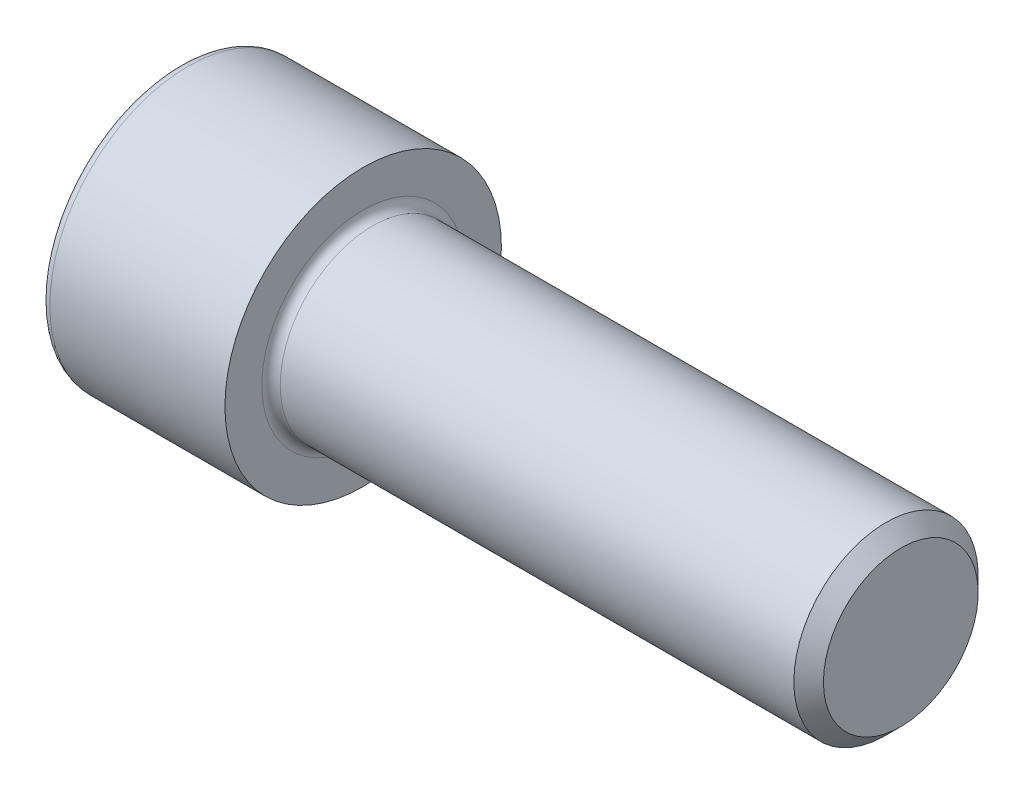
from build123d import *

# Parameters (mm, degrees)
FILLET1_R   = 0.6
FILLET2_R   = 0.6
HEX_2_DEPTH = 6


with BuildPart() as part:
    # BodySke → Base-Revolve (revolve)
    with BuildSketch(Plane.XY, mode=Mode.PRIVATE) as base_revolve_sk:
        Polygon((0, 0), (0, 9), (12, 9), (12, 6), (46.036, 6), (47, 5.036), (47, 0), align=None)
    revolve(base_revolve_sk.sketch.rotate(Axis((-31.75, 0, 0), (1, 0, 0)), 90), axis=Axis((-31.75, 0, 0), (1, 0, 0)))

    # Fillet1
    fillet1_edges = [part.edges().sort_by_distance(p)[0] for p in [
        (12, 0, -6),
    ]]
    fillet(fillet1_edges, radius=FILLET1_R)

    # Fillet2
    fillet2_edges = [part.edges().sort_by_distance(p)[0] for p in [
        (0, 0, -9),
    ]]
    fillet(fillet2_edges, radius=FILLET2_R)

    # Sketch2 → Hex-PreBroach (revolve, cut)
    with BuildSketch(Plane.XY, mode=Mode.PRIVATE) as hex_prebroach_sk:
        Polygon((0, 5.0575), (6, 5.0575), (8.919948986, 0), (0, 0), align=None)
    revolve(hex_prebroach_sk.sketch.rotate(Axis((0, 0, 0), (1, 0, 0)), 90), axis=Axis((0, 0, 0), (1, 0, 0)), mode=Mode.SUBTRACT)

    # Sketch3 → Hex 2 (cut)
    with BuildSketch(Plane(origin=(0, 0, 0), x_dir=(0, 0.500000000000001, 0.866025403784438), z_dir=(-1, 0, 0))):
        Polygon((2.919948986, 5.0575), (-2.919948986, 5.0575), (-5.839897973, 0), (-2.919948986, -5.0575), (2.919948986, -5.0575), (5.839897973, 0), align=None)
    extrude(amount=-HEX_2_DEPTH, mode=Mode.SUBTRACT)


solid = part.part
